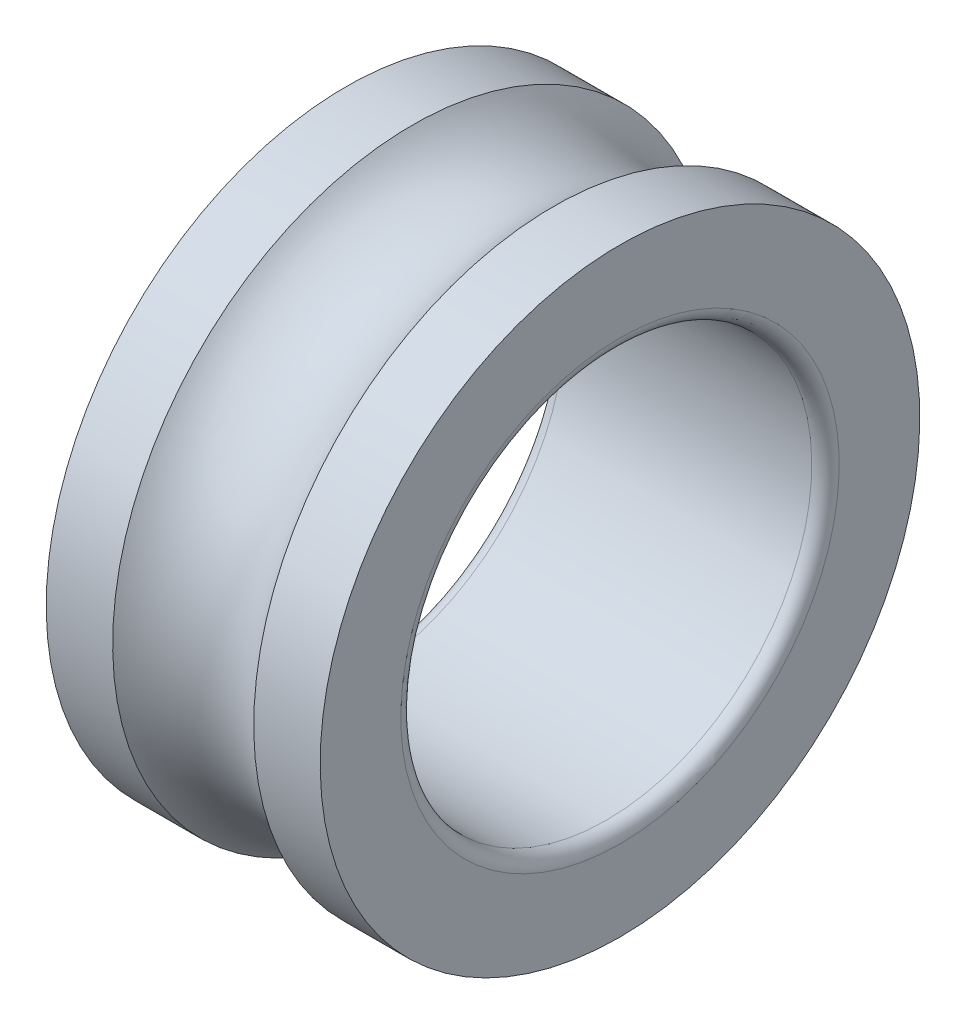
ISO-10303-21;
HEADER;
FILE_DESCRIPTION(('STEP AP214'),'2;1');
FILE_NAME('part.step','',(''),(''),'','','');
FILE_SCHEMA(('AUTOMOTIVE_DESIGN { 1 0 10303 214 1 1 1 1 }'));
ENDSEC;
DATA;
#1=APPLICATION_CONTEXT('core data for automotive mechanical design processes');
#2=APPLICATION_PROTOCOL_DEFINITION('international standard','automotive_design',2000,#1);
#3=PRODUCT_CONTEXT('',#1,'mechanical');
#4=PRODUCT('Part','Part','',(#3));
#5=PRODUCT_RELATED_PRODUCT_CATEGORY('part','',(#4));
#6=PRODUCT_DEFINITION_FORMATION('','',#4);
#7=PRODUCT_DEFINITION_CONTEXT('part definition',#1,'design');
#8=PRODUCT_DEFINITION('design','',#6,#7);
#9=PRODUCT_DEFINITION_SHAPE('','',#8);
#10=(LENGTH_UNIT() NAMED_UNIT(*) SI_UNIT(.MILLI.,.METRE.));
#11=(NAMED_UNIT(*) PLANE_ANGLE_UNIT() SI_UNIT($,.RADIAN.));
#12=(NAMED_UNIT(*) SI_UNIT($,.STERADIAN.) SOLID_ANGLE_UNIT());
#13=UNCERTAINTY_MEASURE_WITH_UNIT(LENGTH_MEASURE(1.E-05),#10,'distance_accuracy_value','');
#14=(GEOMETRIC_REPRESENTATION_CONTEXT(3) GLOBAL_UNCERTAINTY_ASSIGNED_CONTEXT((#13)) GLOBAL_UNIT_ASSIGNED_CONTEXT((#10,
#11,#12)) REPRESENTATION_CONTEXT('',''));
#15=CARTESIAN_POINT('',(0.,0.,0.));
#16=DIRECTION('',(0.,0.,1.));
#17=DIRECTION('',(1.,0.,0.));
#18=AXIS2_PLACEMENT_3D('',#15,#16,#17);
#19=CARTESIAN_POINT('',(8.00000000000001,-3.88578058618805E-13,0.));
#20=DIRECTION('',(-1.,0.,0.));
#21=DIRECTION('',(0.,-1.,0.));
#22=AXIS2_PLACEMENT_3D('',#19,#20,#21);
#23=CYLINDRICAL_SURFACE('',#22,8.754);
#24=CARTESIAN_POINT('',(0.,0.,0.));
#25=DIRECTION('',(-1.,0.,0.));
#26=DIRECTION('',(0.,-1.,0.));
#27=AXIS2_PLACEMENT_3D('',#24,#25,#26);
#28=CIRCLE('',#27,8.754);
#29=CARTESIAN_POINT('',(0.,-8.754,0.));
#30=VERTEX_POINT('',#29);
#31=EDGE_CURVE('E10',#30,#30,#28,.T.);
#32=ORIENTED_EDGE('',*,*,#31,.F.);
#33=EDGE_LOOP('',(#32));
#34=FACE_BOUND('',#33,.T.);
#35=CARTESIAN_POINT('',(1.94051365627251,-1.66533453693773E-13,0.));
#36=DIRECTION('',(-1.,0.,0.));
#37=DIRECTION('',(0.,-1.,0.));
#38=AXIS2_PLACEMENT_3D('',#35,#36,#37);
#39=CIRCLE('',#38,8.754);
#40=CARTESIAN_POINT('',(1.94051365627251,-8.75400000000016,0.));
#41=VERTEX_POINT('',#40);
#42=EDGE_CURVE('E60',#41,#41,#39,.T.);
#43=ORIENTED_EDGE('',*,*,#42,.T.);
#44=EDGE_LOOP('',(#43));
#45=FACE_BOUND('',#44,.T.);
#46=ADVANCED_FACE('F32',(#34,#45),#23,.T.);
#47=CARTESIAN_POINT('',(0.,8.75400000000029,0.));
#48=DIRECTION('',(1.,0.,0.));
#49=DIRECTION('',(0.,1.,0.));
#50=AXIS2_PLACEMENT_3D('',#47,#48,#49);
#51=PLANE('',#50);
#52=CARTESIAN_POINT('',(0.,0.,0.));
#53=DIRECTION('',(-1.,0.,0.));
#54=DIRECTION('',(0.,-1.,0.));
#55=AXIS2_PLACEMENT_3D('',#52,#53,#54);
#56=CIRCLE('',#55,6.4);
#57=CARTESIAN_POINT('',(0.,-6.4,0.));
#58=VERTEX_POINT('',#57);
#59=EDGE_CURVE('E38',#58,#58,#56,.T.);
#60=ORIENTED_EDGE('',*,*,#59,.F.);
#61=EDGE_LOOP('',(#60));
#62=FACE_BOUND('',#61,.T.);
#63=ORIENTED_EDGE('',*,*,#31,.T.);
#64=EDGE_LOOP('',(#63));
#65=FACE_BOUND('',#64,.T.);
#66=ADVANCED_FACE('F97',(#62,#65),#51,.F.);
#67=CARTESIAN_POINT('',(0.400000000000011,0.,0.));
#68=DIRECTION('',(-1.,0.,0.));
#69=DIRECTION('',(0.,-1.,0.));
#70=AXIS2_PLACEMENT_3D('',#67,#68,#69);
#71=TOROIDAL_SURFACE('',#70,6.4,0.399999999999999);
#72=CARTESIAN_POINT('',(0.400000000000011,0.,0.));
#73=DIRECTION('',(-1.,0.,0.));
#74=DIRECTION('',(0.,-1.,0.));
#75=AXIS2_PLACEMENT_3D('',#72,#73,#74);
#76=CIRCLE('',#75,6.);
#77=CARTESIAN_POINT('',(0.400000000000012,-6.,0.));
#78=VERTEX_POINT('',#77);
#79=EDGE_CURVE('E42',#78,#78,#76,.T.);
#80=ORIENTED_EDGE('',*,*,#79,.F.);
#81=EDGE_LOOP('',(#80));
#82=FACE_BOUND('',#81,.T.);
#83=ORIENTED_EDGE('',*,*,#59,.T.);
#84=EDGE_LOOP('',(#83));
#85=FACE_BOUND('',#84,.T.);
#86=ADVANCED_FACE('F92',(#82,#85),#71,.T.);
#87=CARTESIAN_POINT('',(8.00000000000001,-3.88578058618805E-13,0.));
#88=DIRECTION('',(-1.,0.,0.));
#89=DIRECTION('',(0.,-1.,0.));
#90=AXIS2_PLACEMENT_3D('',#87,#88,#89);
#91=CYLINDRICAL_SURFACE('',#90,6.);
#92=CARTESIAN_POINT('',(7.6,1.11022302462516E-13,0.));
#93=DIRECTION('',(-1.,0.,0.));
#94=DIRECTION('',(0.,-1.,0.));
#95=AXIS2_PLACEMENT_3D('',#92,#93,#94);
#96=CIRCLE('',#95,6.);
#97=CARTESIAN_POINT('',(7.6,-5.99999999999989,0.));
#98=VERTEX_POINT('',#97);
#99=EDGE_CURVE('E46',#98,#98,#96,.T.);
#100=ORIENTED_EDGE('',*,*,#99,.F.);
#101=EDGE_LOOP('',(#100));
#102=FACE_BOUND('',#101,.T.);
#103=ORIENTED_EDGE('',*,*,#79,.T.);
#104=EDGE_LOOP('',(#103));
#105=FACE_BOUND('',#104,.T.);
#106=ADVANCED_FACE('F86',(#102,#105),#91,.F.);
#107=CARTESIAN_POINT('',(7.6,1.11022302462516E-13,0.));
#108=DIRECTION('',(-1.,0.,0.));
#109=DIRECTION('',(0.,-1.,0.));
#110=AXIS2_PLACEMENT_3D('',#107,#108,#109);
#111=TOROIDAL_SURFACE('',#110,6.4,0.400000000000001);
#112=CARTESIAN_POINT('',(8.00000000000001,-3.88578058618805E-13,0.));
#113=DIRECTION('',(-1.,0.,0.));
#114=DIRECTION('',(0.,-1.,0.));
#115=AXIS2_PLACEMENT_3D('',#112,#113,#114);
#116=CIRCLE('',#115,6.4);
#117=CARTESIAN_POINT('',(8.00000000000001,-6.40000000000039,0.));
#118=VERTEX_POINT('',#117);
#119=EDGE_CURVE('E51',#118,#118,#116,.T.);
#120=ORIENTED_EDGE('',*,*,#119,.F.);
#121=EDGE_LOOP('',(#120));
#122=FACE_BOUND('',#121,.T.);
#123=ORIENTED_EDGE('',*,*,#99,.T.);
#124=EDGE_LOOP('',(#123));
#125=FACE_BOUND('',#124,.T.);
#126=ADVANCED_FACE('F80',(#122,#125),#111,.T.);
#127=CARTESIAN_POINT('',(8.00000000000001,6.40000000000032,0.));
#128=DIRECTION('',(-1.,0.,0.));
#129=DIRECTION('',(0.,-1.,0.));
#130=AXIS2_PLACEMENT_3D('',#127,#128,#129);
#131=PLANE('',#130);
#132=CARTESIAN_POINT('',(8.00000000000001,-3.88578058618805E-13,0.));
#133=DIRECTION('',(-1.,0.,0.));
#134=DIRECTION('',(0.,-1.,0.));
#135=AXIS2_PLACEMENT_3D('',#132,#133,#134);
#136=CIRCLE('',#135,8.754);
#137=CARTESIAN_POINT('',(8.00000000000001,-8.75400000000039,0.));
#138=VERTEX_POINT('',#137);
#139=EDGE_CURVE('E54',#138,#138,#136,.T.);
#140=ORIENTED_EDGE('',*,*,#139,.F.);
#141=EDGE_LOOP('',(#140));
#142=FACE_BOUND('',#141,.T.);
#143=ORIENTED_EDGE('',*,*,#119,.T.);
#144=EDGE_LOOP('',(#143));
#145=FACE_BOUND('',#144,.T.);
#146=ADVANCED_FACE('F74',(#142,#145),#131,.F.);
#147=CARTESIAN_POINT('',(8.00000000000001,-3.88578058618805E-13,0.));
#148=DIRECTION('',(-1.,0.,0.));
#149=DIRECTION('',(0.,-1.,0.));
#150=AXIS2_PLACEMENT_3D('',#147,#148,#149);
#151=CYLINDRICAL_SURFACE('',#150,8.754);
#152=CARTESIAN_POINT('',(6.05948634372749,0.,0.));
#153=DIRECTION('',(-1.,0.,0.));
#154=DIRECTION('',(0.,-1.,0.));
#155=AXIS2_PLACEMENT_3D('',#152,#153,#154);
#156=CIRCLE('',#155,8.754);
#157=CARTESIAN_POINT('',(6.05948634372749,-8.75400000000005,0.));
#158=VERTEX_POINT('',#157);
#159=EDGE_CURVE('E57',#158,#158,#156,.T.);
#160=ORIENTED_EDGE('',*,*,#159,.F.);
#161=EDGE_LOOP('',(#160));
#162=FACE_BOUND('',#161,.T.);
#163=ORIENTED_EDGE('',*,*,#139,.T.);
#164=EDGE_LOOP('',(#163));
#165=FACE_BOUND('',#164,.T.);
#166=ADVANCED_FACE('F68',(#162,#165),#151,.T.);
#167=CARTESIAN_POINT('',(4.,-1.66533453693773E-13,0.));
#168=DIRECTION('',(-1.,0.,0.));
#169=DIRECTION('',(0.,-1.,0.));
#170=AXIS2_PLACEMENT_3D('',#167,#168,#169);
#171=TOROIDAL_SURFACE('',#170,10.5,2.7);
#172=ORIENTED_EDGE('',*,*,#42,.F.);
#173=EDGE_LOOP('',(#172));
#174=FACE_BOUND('',#173,.T.);
#175=ORIENTED_EDGE('',*,*,#159,.T.);
#176=EDGE_LOOP('',(#175));
#177=FACE_BOUND('',#176,.T.);
#178=ADVANCED_FACE('F65',(#174,#177),#171,.F.);
#179=CLOSED_SHELL('',(#46,#66,#86,#106,#126,#146,#166,#178));
#180=MANIFOLD_SOLID_BREP('B2',#179);
#181=ADVANCED_BREP_SHAPE_REPRESENTATION('',(#18,#180),#14);
#182=SHAPE_DEFINITION_REPRESENTATION(#9,#181);
ENDSEC;
END-ISO-10303-21;
